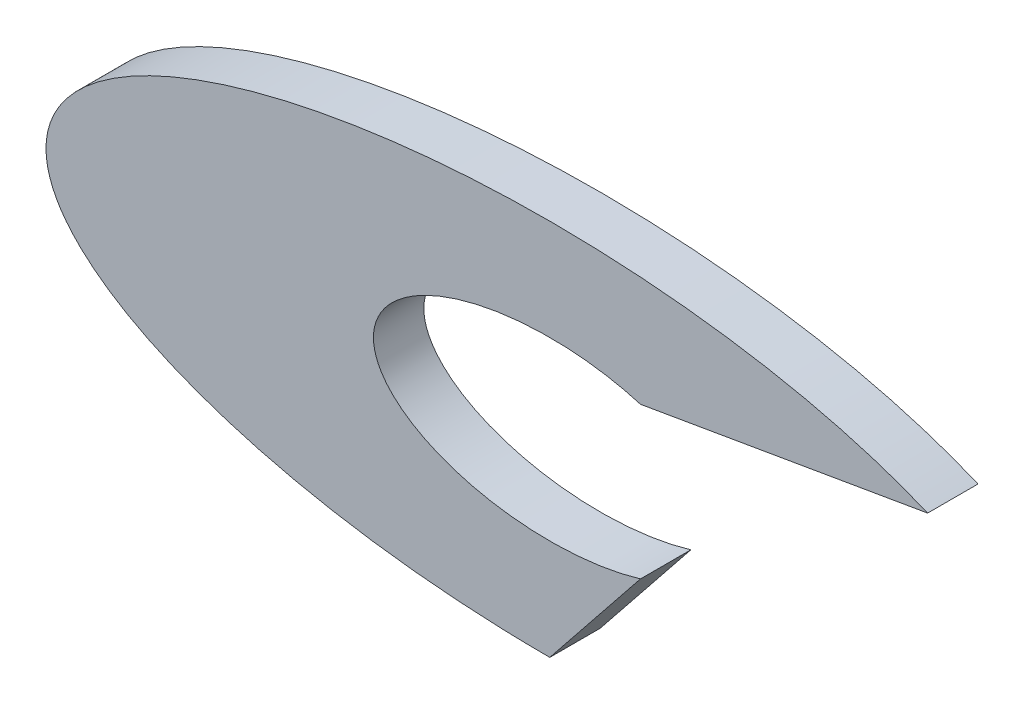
from build123d import *

# Parameters (mm, degrees)
EXTRUDE1_DEPTH = 10


with BuildPart() as part:
    # Sketch1 → Extrude1 (new body)
    with BuildSketch(Plane.XY):
        with BuildLine():
            Line((18, 15.00833102), (75, 24.803918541))
            add(Edge.make_bspline(
                [(75, 24.803918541), (-27.429188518, 68.357837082), (-91.143782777, 15.428918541), (-154.858377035, -37.5), (0, -37.5)],
                knots=[0.722734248, 0.722734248, 0.722734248, 2.717561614, 2.717561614, 4.71238898, 4.71238898, 4.71238898], degree=2, weights=[1, 0.542476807, 1, 0.542476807, 1]))
            Line((0, -37.5), (18, -15.00833102))
            add(Edge.make_bspline(
                [(18, 15.00833102), (-35, 30.899505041), (-35, 0), (-35, -30.899505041), (18, -15.00833102)],
                knots=[1.030621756, 1.030621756, 1.030621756, 3.141592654, 3.141592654, 5.252563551, 5.252563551, 5.252563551], degree=2, weights=[1, 0.49280538, 1, 0.49280538, 1]))
        make_face()
    extrude(amount=EXTRUDE1_DEPTH)


solid = part.part
